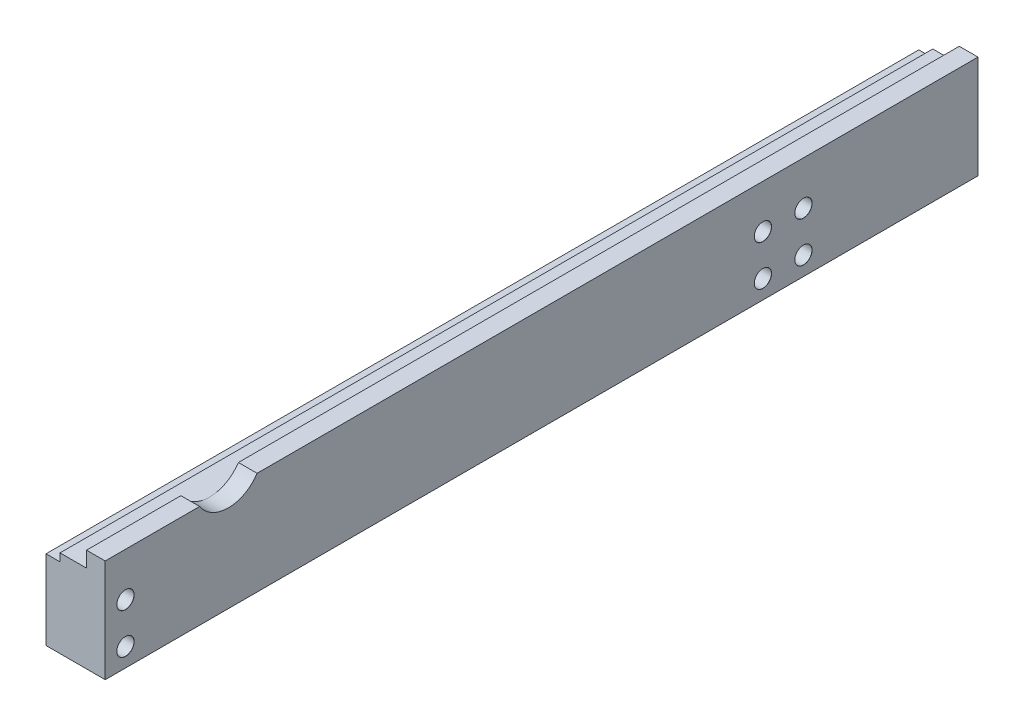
ISO-10303-21;
HEADER;
FILE_DESCRIPTION(('STEP AP214'),'2;1');
FILE_NAME('part.step','',(''),(''),'','','');
FILE_SCHEMA(('AUTOMOTIVE_DESIGN { 1 0 10303 214 1 1 1 1 }'));
ENDSEC;
DATA;
#1=APPLICATION_CONTEXT('core data for automotive mechanical design processes');
#2=APPLICATION_PROTOCOL_DEFINITION('international standard','automotive_design',2000,#1);
#3=PRODUCT_CONTEXT('',#1,'mechanical');
#4=PRODUCT('Part','Part','',(#3));
#5=PRODUCT_RELATED_PRODUCT_CATEGORY('part','',(#4));
#6=PRODUCT_DEFINITION_FORMATION('','',#4);
#7=PRODUCT_DEFINITION_CONTEXT('part definition',#1,'design');
#8=PRODUCT_DEFINITION('design','',#6,#7);
#9=PRODUCT_DEFINITION_SHAPE('','',#8);
#10=(LENGTH_UNIT() NAMED_UNIT(*) SI_UNIT(.MILLI.,.METRE.));
#11=(NAMED_UNIT(*) PLANE_ANGLE_UNIT() SI_UNIT($,.RADIAN.));
#12=(NAMED_UNIT(*) SI_UNIT($,.STERADIAN.) SOLID_ANGLE_UNIT());
#13=UNCERTAINTY_MEASURE_WITH_UNIT(LENGTH_MEASURE(1.E-05),#10,'distance_accuracy_value','');
#14=(GEOMETRIC_REPRESENTATION_CONTEXT(3) GLOBAL_UNCERTAINTY_ASSIGNED_CONTEXT((#13)) GLOBAL_UNIT_ASSIGNED_CONTEXT((#10,
#11,#12)) REPRESENTATION_CONTEXT('',''));
#15=CARTESIAN_POINT('',(0.,0.,0.));
#16=DIRECTION('',(0.,0.,1.));
#17=DIRECTION('',(1.,0.,0.));
#18=AXIS2_PLACEMENT_3D('',#15,#16,#17);
#19=CARTESIAN_POINT('',(-159.,251.054588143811,280.));
#20=DIRECTION('',(0.,-1.,0.));
#21=DIRECTION('',(0.,0.,-1.));
#22=AXIS2_PLACEMENT_3D('',#19,#20,#21);
#23=PLANE('',#22);
#24=DIRECTION('',(0.,0.,-1.));
#25=VECTOR('',#24,1.);
#26=CARTESIAN_POINT('',(-165.,251.054588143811,280.));
#27=LINE('',#26,#25);
#28=CARTESIAN_POINT('',(-165.,251.054588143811,231.280455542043));
#29=VERTEX_POINT('',#28);
#30=CARTESIAN_POINT('',(-165.,251.054588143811,0.));
#31=VERTEX_POINT('',#30);
#32=EDGE_CURVE('E161',#29,#31,#27,.T.);
#33=ORIENTED_EDGE('',*,*,#32,.F.);
#34=DIRECTION('',(1.,0.,0.));
#35=VECTOR('',#34,1.);
#36=CARTESIAN_POINT('',(-178.,251.054588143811,231.280455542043));
#37=LINE('',#36,#35);
#38=CARTESIAN_POINT('',(-159.,251.054588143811,231.280455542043));
#39=VERTEX_POINT('',#38);
#40=EDGE_CURVE('E31',#29,#39,#37,.T.);
#41=ORIENTED_EDGE('',*,*,#40,.T.);
#42=DIRECTION('',(0.,0.,-1.));
#43=VECTOR('',#42,1.);
#44=CARTESIAN_POINT('',(-159.,251.054588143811,280.));
#45=LINE('',#44,#43);
#46=CARTESIAN_POINT('',(-159.,251.054588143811,0.));
#47=VERTEX_POINT('',#46);
#48=EDGE_CURVE('E24',#39,#47,#45,.T.);
#49=ORIENTED_EDGE('',*,*,#48,.T.);
#50=DIRECTION('',(-1.,0.,0.));
#51=VECTOR('',#50,1.);
#52=CARTESIAN_POINT('',(-159.,251.054588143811,0.));
#53=LINE('',#52,#51);
#54=EDGE_CURVE('E145',#47,#31,#53,.T.);
#55=ORIENTED_EDGE('',*,*,#54,.T.);
#56=EDGE_LOOP('',(#33,#41,#49,#55));
#57=FACE_BOUND('',#56,.T.);
#58=ADVANCED_FACE('F16',(#57),#23,.F.);
#59=CARTESIAN_POINT('',(-165.,251.054588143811,280.));
#60=DIRECTION('',(1.,0.,0.));
#61=DIRECTION('',(0.,0.,-1.));
#62=AXIS2_PLACEMENT_3D('',#59,#60,#61);
#63=PLANE('',#62);
#64=CARTESIAN_POINT('',(-165.,251.054588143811,280.));
#65=VERTEX_POINT('',#64);
#66=CARTESIAN_POINT('',(-165.,251.054588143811,249.719544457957));
#67=VERTEX_POINT('',#66);
#68=EDGE_CURVE('E117',#65,#67,#27,.T.);
#69=ORIENTED_EDGE('',*,*,#68,.T.);
#70=CARTESIAN_POINT('',(-165.,257.05458814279,240.5));
#71=DIRECTION('',(1.,0.,0.));
#72=DIRECTION('',(0.,0.,-1.));
#73=AXIS2_PLACEMENT_3D('',#70,#71,#72);
#74=CIRCLE('',#73,11.);
#75=CARTESIAN_POINT('',(-165.,246.0545881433,240.5));
#76=VERTEX_POINT('',#75);
#77=EDGE_CURVE('E100',#67,#76,#74,.T.);
#78=ORIENTED_EDGE('',*,*,#77,.T.);
#79=DIRECTION('',(0.,0.,-1.));
#80=VECTOR('',#79,1.);
#81=CARTESIAN_POINT('',(-165.,246.05458814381,280.));
#82=LINE('',#81,#80);
#83=CARTESIAN_POINT('',(-165.,246.05458814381,280.));
#84=VERTEX_POINT('',#83);
#85=EDGE_CURVE('E146',#84,#76,#82,.T.);
#86=ORIENTED_EDGE('',*,*,#85,.F.);
#87=DIRECTION('',(0.,-1.,0.));
#88=VECTOR('',#87,1.);
#89=CARTESIAN_POINT('',(-165.,251.054588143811,280.));
#90=LINE('',#89,#88);
#91=EDGE_CURVE('E121',#65,#84,#90,.T.);
#92=ORIENTED_EDGE('',*,*,#91,.F.);
#93=EDGE_LOOP('',(#69,#78,#86,#92));
#94=FACE_BOUND('',#93,.T.);
#95=ADVANCED_FACE('F392',(#94),#63,.F.);
#96=CARTESIAN_POINT('',(-159.,218.05458814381,280.));
#97=DIRECTION('',(-1.,0.,0.));
#98=DIRECTION('',(0.,0.,1.));
#99=AXIS2_PLACEMENT_3D('',#96,#97,#98);
#100=PLANE('',#99);
#101=CARTESIAN_POINT('',(-159.,224.05458814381,56.));
#102=DIRECTION('',(-1.,0.,0.));
#103=DIRECTION('',(0.,0.,1.));
#104=AXIS2_PLACEMENT_3D('',#101,#102,#103);
#105=CIRCLE('',#104,2.775);
#106=CARTESIAN_POINT('',(-159.,224.05458814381,58.775));
#107=VERTEX_POINT('',#106);
#108=EDGE_CURVE('E318',#107,#107,#105,.T.);
#109=ORIENTED_EDGE('',*,*,#108,.T.);
#110=EDGE_LOOP('',(#109));
#111=FACE_BOUND('',#110,.T.);
#112=CARTESIAN_POINT('',(-159.,237.05458814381,56.));
#113=DIRECTION('',(-1.,0.,0.));
#114=DIRECTION('',(0.,0.,1.));
#115=AXIS2_PLACEMENT_3D('',#112,#113,#114);
#116=CIRCLE('',#115,2.775);
#117=CARTESIAN_POINT('',(-159.,237.05458814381,58.775));
#118=VERTEX_POINT('',#117);
#119=EDGE_CURVE('E297',#118,#118,#116,.T.);
#120=ORIENTED_EDGE('',*,*,#119,.T.);
#121=EDGE_LOOP('',(#120));
#122=FACE_BOUND('',#121,.T.);
#123=CARTESIAN_POINT('',(-159.,237.05458814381,69.));
#124=DIRECTION('',(-1.,0.,0.));
#125=DIRECTION('',(0.,0.,1.));
#126=AXIS2_PLACEMENT_3D('',#123,#124,#125);
#127=CIRCLE('',#126,2.775);
#128=CARTESIAN_POINT('',(-159.,237.05458814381,71.775));
#129=VERTEX_POINT('',#128);
#130=EDGE_CURVE('E276',#129,#129,#127,.T.);
#131=ORIENTED_EDGE('',*,*,#130,.T.);
#132=EDGE_LOOP('',(#131));
#133=FACE_BOUND('',#132,.T.);
#134=CARTESIAN_POINT('',(-159.,224.05458814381,69.));
#135=DIRECTION('',(-1.,0.,0.));
#136=DIRECTION('',(0.,0.,1.));
#137=AXIS2_PLACEMENT_3D('',#134,#135,#136);
#138=CIRCLE('',#137,2.775);
#139=CARTESIAN_POINT('',(-159.,224.05458814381,71.775));
#140=VERTEX_POINT('',#139);
#141=EDGE_CURVE('E255',#140,#140,#138,.T.);
#142=ORIENTED_EDGE('',*,*,#141,.T.);
#143=EDGE_LOOP('',(#142));
#144=FACE_BOUND('',#143,.T.);
#145=CARTESIAN_POINT('',(-159.,237.05458814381,273.5));
#146=DIRECTION('',(-1.,0.,0.));
#147=DIRECTION('',(0.,0.,1.));
#148=AXIS2_PLACEMENT_3D('',#145,#146,#147);
#149=CIRCLE('',#148,2.775);
#150=CARTESIAN_POINT('',(-159.,237.05458814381,276.275));
#151=VERTEX_POINT('',#150);
#152=EDGE_CURVE('E234',#151,#151,#149,.T.);
#153=ORIENTED_EDGE('',*,*,#152,.T.);
#154=EDGE_LOOP('',(#153));
#155=FACE_BOUND('',#154,.T.);
#156=CARTESIAN_POINT('',(-159.,224.05458814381,273.5));
#157=DIRECTION('',(-1.,0.,0.));
#158=DIRECTION('',(0.,0.,1.));
#159=AXIS2_PLACEMENT_3D('',#156,#157,#158);
#160=CIRCLE('',#159,2.775);
#161=CARTESIAN_POINT('',(-159.,224.05458814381,276.275));
#162=VERTEX_POINT('',#161);
#163=EDGE_CURVE('E213',#162,#162,#160,.T.);
#164=ORIENTED_EDGE('',*,*,#163,.T.);
#165=EDGE_LOOP('',(#164));
#166=FACE_BOUND('',#165,.T.);
#167=ORIENTED_EDGE('',*,*,#48,.F.);
#168=CARTESIAN_POINT('',(-159.,257.05458814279,240.5));
#169=DIRECTION('',(1.,0.,0.));
#170=DIRECTION('',(0.,0.,-1.));
#171=AXIS2_PLACEMENT_3D('',#168,#169,#170);
#172=CIRCLE('',#171,11.);
#173=CARTESIAN_POINT('',(-159.,251.054588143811,249.719544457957));
#174=VERTEX_POINT('',#173);
#175=EDGE_CURVE('E98',#174,#39,#172,.T.);
#176=ORIENTED_EDGE('',*,*,#175,.F.);
#177=CARTESIAN_POINT('',(-159.,251.054588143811,280.));
#178=VERTEX_POINT('',#177);
#179=EDGE_CURVE('E11',#178,#174,#45,.T.);
#180=ORIENTED_EDGE('',*,*,#179,.F.);
#181=DIRECTION('',(0.,1.,0.));
#182=VECTOR('',#181,1.);
#183=CARTESIAN_POINT('',(-159.,218.05458814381,280.));
#184=LINE('',#183,#182);
#185=CARTESIAN_POINT('',(-159.,218.05458814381,280.));
#186=VERTEX_POINT('',#185);
#187=EDGE_CURVE('E122',#186,#178,#184,.T.);
#188=ORIENTED_EDGE('',*,*,#187,.F.);
#189=DIRECTION('',(0.,0.,-1.));
#190=VECTOR('',#189,1.);
#191=CARTESIAN_POINT('',(-159.,218.05458814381,280.));
#192=LINE('',#191,#190);
#193=CARTESIAN_POINT('',(-159.,218.05458814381,0.));
#194=VERTEX_POINT('',#193);
#195=EDGE_CURVE('E142',#186,#194,#192,.T.);
#196=ORIENTED_EDGE('',*,*,#195,.T.);
#197=DIRECTION('',(0.,1.,0.));
#198=VECTOR('',#197,1.);
#199=CARTESIAN_POINT('',(-159.,218.05458814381,0.));
#200=LINE('',#199,#198);
#201=EDGE_CURVE('E143',#194,#47,#200,.T.);
#202=ORIENTED_EDGE('',*,*,#201,.T.);
#203=EDGE_LOOP('',(#167,#176,#180,#188,#196,#202));
#204=FACE_BOUND('',#203,.T.);
#205=ADVANCED_FACE('F18',(#111,#122,#133,#144,#155,#166,#204),#100,.F.);
#206=ORIENTED_EDGE('',*,*,#179,.T.);
#207=DIRECTION('',(1.,0.,0.));
#208=VECTOR('',#207,1.);
#209=CARTESIAN_POINT('',(-178.,251.054588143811,249.719544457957));
#210=LINE('',#209,#208);
#211=EDGE_CURVE('E95',#174,#67,#210,.F.);
#212=ORIENTED_EDGE('',*,*,#211,.T.);
#213=ORIENTED_EDGE('',*,*,#68,.F.);
#214=DIRECTION('',(-1.,0.,0.));
#215=VECTOR('',#214,1.);
#216=CARTESIAN_POINT('',(-159.,251.054588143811,280.));
#217=LINE('',#216,#215);
#218=EDGE_CURVE('E115',#178,#65,#217,.T.);
#219=ORIENTED_EDGE('',*,*,#218,.F.);
#220=EDGE_LOOP('',(#206,#212,#213,#219));
#221=FACE_BOUND('',#220,.T.);
#222=ADVANCED_FACE('F114',(#221),#23,.F.);
#223=CARTESIAN_POINT('',(-165.,246.05458814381,0.));
#224=VERTEX_POINT('',#223);
#225=EDGE_CURVE('E188',#76,#224,#82,.T.);
#226=ORIENTED_EDGE('',*,*,#225,.F.);
#227=EDGE_CURVE('E111',#76,#29,#74,.T.);
#228=ORIENTED_EDGE('',*,*,#227,.T.);
#229=ORIENTED_EDGE('',*,*,#32,.T.);
#230=DIRECTION('',(0.,-1.,0.));
#231=VECTOR('',#230,1.);
#232=CARTESIAN_POINT('',(-165.,251.054588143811,0.));
#233=LINE('',#232,#231);
#234=EDGE_CURVE('E149',#31,#224,#233,.T.);
#235=ORIENTED_EDGE('',*,*,#234,.T.);
#236=EDGE_LOOP('',(#226,#228,#229,#235));
#237=FACE_BOUND('',#236,.T.);
#238=ADVANCED_FACE('F166',(#237),#63,.F.);
#239=CARTESIAN_POINT('',(-178.,243.55458814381,280.));
#240=DIRECTION('',(0.,-1.,0.));
#241=DIRECTION('',(0.,0.,-1.));
#242=AXIS2_PLACEMENT_3D('',#239,#240,#241);
#243=PLANE('',#242);
#244=DIRECTION('',(-1.,0.,0.));
#245=VECTOR('',#244,1.);
#246=CARTESIAN_POINT('',(-178.,243.55458814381,280.));
#247=LINE('',#246,#245);
#248=CARTESIAN_POINT('',(-173.5,243.55458814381,280.));
#249=VERTEX_POINT('',#248);
#250=CARTESIAN_POINT('',(-178.,243.55458814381,280.));
#251=VERTEX_POINT('',#250);
#252=EDGE_CURVE('E39',#249,#251,#247,.T.);
#253=ORIENTED_EDGE('',*,*,#252,.F.);
#254=DIRECTION('',(0.,0.,-1.));
#255=VECTOR('',#254,1.);
#256=CARTESIAN_POINT('',(-173.5,243.55458814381,280.));
#257=LINE('',#256,#255);
#258=CARTESIAN_POINT('',(-173.5,243.55458814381,0.));
#259=VERTEX_POINT('',#258);
#260=EDGE_CURVE('E134',#249,#259,#257,.T.);
#261=ORIENTED_EDGE('',*,*,#260,.T.);
#262=DIRECTION('',(-1.,0.,0.));
#263=VECTOR('',#262,1.);
#264=CARTESIAN_POINT('',(-178.,243.55458814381,0.));
#265=LINE('',#264,#263);
#266=CARTESIAN_POINT('',(-178.,243.55458814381,0.));
#267=VERTEX_POINT('',#266);
#268=EDGE_CURVE('E152',#259,#267,#265,.T.);
#269=ORIENTED_EDGE('',*,*,#268,.T.);
#270=DIRECTION('',(0.,0.,-1.));
#271=VECTOR('',#270,1.);
#272=CARTESIAN_POINT('',(-178.,243.55458814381,280.));
#273=LINE('',#272,#271);
#274=EDGE_CURVE('E159',#251,#267,#273,.T.);
#275=ORIENTED_EDGE('',*,*,#274,.F.);
#276=EDGE_LOOP('',(#253,#261,#269,#275));
#277=FACE_BOUND('',#276,.T.);
#278=ADVANCED_FACE('F365',(#277),#243,.F.);
#279=CARTESIAN_POINT('',(-178.,218.05458814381,280.));
#280=DIRECTION('',(1.,0.,0.));
#281=DIRECTION('',(0.,0.,-1.));
#282=AXIS2_PLACEMENT_3D('',#279,#280,#281);
#283=PLANE('',#282);
#284=CARTESIAN_POINT('',(-178.,224.05458814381,56.));
#285=DIRECTION('',(-1.,0.,0.));
#286=DIRECTION('',(0.,0.,1.));
#287=AXIS2_PLACEMENT_3D('',#284,#285,#286);
#288=CIRCLE('',#287,5.025);
#289=CARTESIAN_POINT('',(-178.,224.05458814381,61.025));
#290=VERTEX_POINT('',#289);
#291=EDGE_CURVE('E315',#290,#290,#288,.T.);
#292=ORIENTED_EDGE('',*,*,#291,.F.);
#293=EDGE_LOOP('',(#292));
#294=FACE_BOUND('',#293,.T.);
#295=CARTESIAN_POINT('',(-178.,237.05458814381,56.));
#296=DIRECTION('',(-1.,0.,0.));
#297=DIRECTION('',(0.,0.,1.));
#298=AXIS2_PLACEMENT_3D('',#295,#296,#297);
#299=CIRCLE('',#298,5.025);
#300=CARTESIAN_POINT('',(-178.,237.05458814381,61.025));
#301=VERTEX_POINT('',#300);
#302=EDGE_CURVE('E294',#301,#301,#299,.T.);
#303=ORIENTED_EDGE('',*,*,#302,.F.);
#304=EDGE_LOOP('',(#303));
#305=FACE_BOUND('',#304,.T.);
#306=CARTESIAN_POINT('',(-178.,237.05458814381,69.));
#307=DIRECTION('',(-1.,0.,0.));
#308=DIRECTION('',(0.,0.,1.));
#309=AXIS2_PLACEMENT_3D('',#306,#307,#308);
#310=CIRCLE('',#309,5.025);
#311=CARTESIAN_POINT('',(-178.,237.05458814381,74.025));
#312=VERTEX_POINT('',#311);
#313=EDGE_CURVE('E273',#312,#312,#310,.T.);
#314=ORIENTED_EDGE('',*,*,#313,.F.);
#315=EDGE_LOOP('',(#314));
#316=FACE_BOUND('',#315,.T.);
#317=CARTESIAN_POINT('',(-178.,224.05458814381,69.));
#318=DIRECTION('',(-1.,0.,0.));
#319=DIRECTION('',(0.,0.,1.));
#320=AXIS2_PLACEMENT_3D('',#317,#318,#319);
#321=CIRCLE('',#320,5.025);
#322=CARTESIAN_POINT('',(-178.,224.05458814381,74.025));
#323=VERTEX_POINT('',#322);
#324=EDGE_CURVE('E252',#323,#323,#321,.T.);
#325=ORIENTED_EDGE('',*,*,#324,.F.);
#326=EDGE_LOOP('',(#325));
#327=FACE_BOUND('',#326,.T.);
#328=CARTESIAN_POINT('',(-178.,237.05458814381,273.5));
#329=DIRECTION('',(-1.,0.,0.));
#330=DIRECTION('',(0.,0.,1.));
#331=AXIS2_PLACEMENT_3D('',#328,#329,#330);
#332=CIRCLE('',#331,5.025);
#333=CARTESIAN_POINT('',(-178.,237.05458814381,278.525));
#334=VERTEX_POINT('',#333);
#335=EDGE_CURVE('E231',#334,#334,#332,.T.);
#336=ORIENTED_EDGE('',*,*,#335,.F.);
#337=EDGE_LOOP('',(#336));
#338=FACE_BOUND('',#337,.T.);
#339=CARTESIAN_POINT('',(-178.,224.05458814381,273.5));
#340=DIRECTION('',(-1.,0.,0.));
#341=DIRECTION('',(0.,0.,1.));
#342=AXIS2_PLACEMENT_3D('',#339,#340,#341);
#343=CIRCLE('',#342,5.025);
#344=CARTESIAN_POINT('',(-178.,224.05458814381,278.525));
#345=VERTEX_POINT('',#344);
#346=EDGE_CURVE('E210',#345,#345,#343,.T.);
#347=ORIENTED_EDGE('',*,*,#346,.F.);
#348=EDGE_LOOP('',(#347));
#349=FACE_BOUND('',#348,.T.);
#350=DIRECTION('',(0.,-1.,0.));
#351=VECTOR('',#350,1.);
#352=CARTESIAN_POINT('',(-178.,218.05458814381,0.));
#353=LINE('',#352,#351);
#354=CARTESIAN_POINT('',(-178.,218.05458814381,0.));
#355=VERTEX_POINT('',#354);
#356=EDGE_CURVE('E131',#267,#355,#353,.T.);
#357=ORIENTED_EDGE('',*,*,#356,.T.);
#358=DIRECTION('',(0.,0.,-1.));
#359=VECTOR('',#358,1.);
#360=CARTESIAN_POINT('',(-178.,218.05458814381,280.));
#361=LINE('',#360,#359);
#362=CARTESIAN_POINT('',(-178.,218.05458814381,280.));
#363=VERTEX_POINT('',#362);
#364=EDGE_CURVE('E156',#363,#355,#361,.T.);
#365=ORIENTED_EDGE('',*,*,#364,.F.);
#366=DIRECTION('',(0.,-1.,0.));
#367=VECTOR('',#366,1.);
#368=CARTESIAN_POINT('',(-178.,218.05458814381,280.));
#369=LINE('',#368,#367);
#370=EDGE_CURVE('E139',#251,#363,#369,.T.);
#371=ORIENTED_EDGE('',*,*,#370,.F.);
#372=ORIENTED_EDGE('',*,*,#274,.T.);
#373=EDGE_LOOP('',(#357,#365,#371,#372));
#374=FACE_BOUND('',#373,.T.);
#375=ADVANCED_FACE('F361',(#294,#305,#316,#327,#338,#349,#374),#283,.F.);
#376=CARTESIAN_POINT('',(-159.,218.05458814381,280.));
#377=DIRECTION('',(0.,1.,0.));
#378=DIRECTION('',(0.,0.,1.));
#379=AXIS2_PLACEMENT_3D('',#376,#377,#378);
#380=PLANE('',#379);
#381=DIRECTION('',(1.,0.,0.));
#382=VECTOR('',#381,1.);
#383=CARTESIAN_POINT('',(-159.,218.05458814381,0.));
#384=LINE('',#383,#382);
#385=EDGE_CURVE('E129',#355,#194,#384,.T.);
#386=ORIENTED_EDGE('',*,*,#385,.T.);
#387=ORIENTED_EDGE('',*,*,#195,.F.);
#388=DIRECTION('',(1.,0.,0.));
#389=VECTOR('',#388,1.);
#390=CARTESIAN_POINT('',(-159.,218.05458814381,280.));
#391=LINE('',#390,#389);
#392=EDGE_CURVE('E126',#363,#186,#391,.T.);
#393=ORIENTED_EDGE('',*,*,#392,.F.);
#394=ORIENTED_EDGE('',*,*,#364,.T.);
#395=EDGE_LOOP('',(#386,#387,#393,#394));
#396=FACE_BOUND('',#395,.T.);
#397=ADVANCED_FACE('F364',(#396),#380,.F.);
#398=CARTESIAN_POINT('',(0.,0.,280.));
#399=DIRECTION('',(0.,0.,1.));
#400=DIRECTION('',(1.,0.,0.));
#401=AXIS2_PLACEMENT_3D('',#398,#399,#400);
#402=PLANE('',#401);
#403=ORIENTED_EDGE('',*,*,#187,.T.);
#404=ORIENTED_EDGE('',*,*,#218,.T.);
#405=ORIENTED_EDGE('',*,*,#91,.T.);
#406=DIRECTION('',(1.,0.,0.));
#407=VECTOR('',#406,1.);
#408=CARTESIAN_POINT('',(-165.,246.05458814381,280.));
#409=LINE('',#408,#407);
#410=CARTESIAN_POINT('',(-173.5,246.05458814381,280.));
#411=VERTEX_POINT('',#410);
#412=EDGE_CURVE('E182',#411,#84,#409,.T.);
#413=ORIENTED_EDGE('',*,*,#412,.F.);
#414=DIRECTION('',(0.,1.,0.));
#415=VECTOR('',#414,1.);
#416=CARTESIAN_POINT('',(-173.5,243.55458814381,280.));
#417=LINE('',#416,#415);
#418=EDGE_CURVE('E179',#249,#411,#417,.T.);
#419=ORIENTED_EDGE('',*,*,#418,.F.);
#420=ORIENTED_EDGE('',*,*,#252,.T.);
#421=ORIENTED_EDGE('',*,*,#370,.T.);
#422=ORIENTED_EDGE('',*,*,#392,.T.);
#423=EDGE_LOOP('',(#403,#404,#405,#413,#419,#420,#421,#422));
#424=FACE_BOUND('',#423,.T.);
#425=ADVANCED_FACE('F124',(#424),#402,.T.);
#426=CARTESIAN_POINT('',(0.,0.,0.));
#427=DIRECTION('',(0.,0.,1.));
#428=DIRECTION('',(1.,0.,0.));
#429=AXIS2_PLACEMENT_3D('',#426,#427,#428);
#430=PLANE('',#429);
#431=ORIENTED_EDGE('',*,*,#201,.F.);
#432=ORIENTED_EDGE('',*,*,#385,.F.);
#433=ORIENTED_EDGE('',*,*,#356,.F.);
#434=ORIENTED_EDGE('',*,*,#268,.F.);
#435=DIRECTION('',(0.,1.,0.));
#436=VECTOR('',#435,1.);
#437=CARTESIAN_POINT('',(-173.5,243.55458814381,0.));
#438=LINE('',#437,#436);
#439=CARTESIAN_POINT('',(-173.5,246.05458814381,0.));
#440=VERTEX_POINT('',#439);
#441=EDGE_CURVE('E104',#259,#440,#438,.T.);
#442=ORIENTED_EDGE('',*,*,#441,.T.);
#443=DIRECTION('',(1.,0.,0.));
#444=VECTOR('',#443,1.);
#445=CARTESIAN_POINT('',(-165.,246.05458814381,0.));
#446=LINE('',#445,#444);
#447=EDGE_CURVE('E176',#440,#224,#446,.T.);
#448=ORIENTED_EDGE('',*,*,#447,.T.);
#449=ORIENTED_EDGE('',*,*,#234,.F.);
#450=ORIENTED_EDGE('',*,*,#54,.F.);
#451=EDGE_LOOP('',(#431,#432,#433,#434,#442,#448,#449,#450));
#452=FACE_BOUND('',#451,.T.);
#453=ADVANCED_FACE('F173',(#452),#430,.F.);
#454=CARTESIAN_POINT('',(-165.,246.05458814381,280.));
#455=DIRECTION('',(0.,1.,0.));
#456=DIRECTION('',(0.,0.,1.));
#457=AXIS2_PLACEMENT_3D('',#454,#455,#456);
#458=PLANE('',#457);
#459=ORIENTED_EDGE('',*,*,#85,.T.);
#460=ORIENTED_EDGE('',*,*,#225,.T.);
#461=ORIENTED_EDGE('',*,*,#447,.F.);
#462=DIRECTION('',(0.,0.,-1.));
#463=VECTOR('',#462,1.);
#464=CARTESIAN_POINT('',(-173.5,246.05458814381,280.));
#465=LINE('',#464,#463);
#466=EDGE_CURVE('E189',#411,#440,#465,.T.);
#467=ORIENTED_EDGE('',*,*,#466,.F.);
#468=ORIENTED_EDGE('',*,*,#412,.T.);
#469=EDGE_LOOP('',(#459,#460,#461,#467,#468));
#470=FACE_BOUND('',#469,.T.);
#471=ADVANCED_FACE('F779',(#470),#458,.T.);
#472=CARTESIAN_POINT('',(-173.5,243.55458814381,280.));
#473=DIRECTION('',(-1.,0.,0.));
#474=DIRECTION('',(0.,0.,1.));
#475=AXIS2_PLACEMENT_3D('',#472,#473,#474);
#476=PLANE('',#475);
#477=ORIENTED_EDGE('',*,*,#441,.F.);
#478=ORIENTED_EDGE('',*,*,#260,.F.);
#479=ORIENTED_EDGE('',*,*,#418,.T.);
#480=ORIENTED_EDGE('',*,*,#466,.T.);
#481=EDGE_LOOP('',(#477,#478,#479,#480));
#482=FACE_BOUND('',#481,.T.);
#483=ADVANCED_FACE('F770',(#482),#476,.T.);
#484=CARTESIAN_POINT('',(-178.,257.05458814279,240.5));
#485=DIRECTION('',(1.,0.,0.));
#486=DIRECTION('',(0.,0.,-1.));
#487=AXIS2_PLACEMENT_3D('',#484,#485,#486);
#488=CYLINDRICAL_SURFACE('',#487,11.);
#489=ORIENTED_EDGE('',*,*,#175,.T.);
#490=ORIENTED_EDGE('',*,*,#40,.F.);
#491=ORIENTED_EDGE('',*,*,#227,.F.);
#492=ORIENTED_EDGE('',*,*,#77,.F.);
#493=ORIENTED_EDGE('',*,*,#211,.F.);
#494=EDGE_LOOP('',(#489,#490,#491,#492,#493));
#495=FACE_BOUND('',#494,.T.);
#496=ADVANCED_FACE('F97',(#495),#488,.F.);
#497=CARTESIAN_POINT('',(-159.025,224.05458814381,273.5));
#498=DIRECTION('',(1.,0.,0.));
#499=DIRECTION('',(0.,0.,-1.));
#500=AXIS2_PLACEMENT_3D('',#497,#498,#499);
#501=CONICAL_SURFACE('',#500,2.75,0.785398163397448);
#502=ORIENTED_EDGE('',*,*,#163,.F.);
#503=EDGE_LOOP('',(#502));
#504=FACE_BOUND('',#503,.T.);
#505=CARTESIAN_POINT('',(-159.025,224.05458814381,273.5));
#506=DIRECTION('',(-1.,0.,0.));
#507=DIRECTION('',(0.,0.,1.));
#508=AXIS2_PLACEMENT_3D('',#505,#506,#507);
#509=CIRCLE('',#508,2.75);
#510=CARTESIAN_POINT('',(-159.025,224.05458814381,276.25));
#511=VERTEX_POINT('',#510);
#512=EDGE_CURVE('E112',#511,#511,#509,.T.);
#513=ORIENTED_EDGE('',*,*,#512,.T.);
#514=EDGE_LOOP('',(#513));
#515=FACE_BOUND('',#514,.T.);
#516=ADVANCED_FACE('F751',(#504,#515),#501,.F.);
#517=CARTESIAN_POINT('',(-178.,224.05458814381,273.5));
#518=DIRECTION('',(-1.,0.,0.));
#519=DIRECTION('',(0.,0.,1.));
#520=AXIS2_PLACEMENT_3D('',#517,#518,#519);
#521=CYLINDRICAL_SURFACE('',#520,2.75);
#522=ORIENTED_EDGE('',*,*,#512,.F.);
#523=EDGE_LOOP('',(#522));
#524=FACE_BOUND('',#523,.T.);
#525=CARTESIAN_POINT('',(-172.275,224.05458814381,273.5));
#526=DIRECTION('',(-1.,0.,0.));
#527=DIRECTION('',(0.,0.,1.));
#528=AXIS2_PLACEMENT_3D('',#525,#526,#527);
#529=CIRCLE('',#528,2.75);
#530=CARTESIAN_POINT('',(-172.275,224.05458814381,276.25));
#531=VERTEX_POINT('',#530);
#532=EDGE_CURVE('E198',#531,#531,#529,.T.);
#533=ORIENTED_EDGE('',*,*,#532,.T.);
#534=EDGE_LOOP('',(#533));
#535=FACE_BOUND('',#534,.T.);
#536=ADVANCED_FACE('F741',(#524,#535),#521,.F.);
#537=CARTESIAN_POINT('',(-172.3,224.05458814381,273.5));
#538=DIRECTION('',(-1.,0.,0.));
#539=DIRECTION('',(0.,0.,1.));
#540=AXIS2_PLACEMENT_3D('',#537,#538,#539);
#541=CONICAL_SURFACE('',#540,2.775,0.785398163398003);
#542=ORIENTED_EDGE('',*,*,#532,.F.);
#543=EDGE_LOOP('',(#542));
#544=FACE_BOUND('',#543,.T.);
#545=CARTESIAN_POINT('',(-172.3,224.05458814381,273.5));
#546=DIRECTION('',(-1.,0.,0.));
#547=DIRECTION('',(0.,0.,1.));
#548=AXIS2_PLACEMENT_3D('',#545,#546,#547);
#549=CIRCLE('',#548,2.775);
#550=CARTESIAN_POINT('',(-172.3,224.05458814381,276.275));
#551=VERTEX_POINT('',#550);
#552=EDGE_CURVE('E201',#551,#551,#549,.T.);
#553=ORIENTED_EDGE('',*,*,#552,.T.);
#554=EDGE_LOOP('',(#553));
#555=FACE_BOUND('',#554,.T.);
#556=ADVANCED_FACE('F731',(#544,#555),#541,.F.);
#557=CARTESIAN_POINT('',(-172.3,226.82958814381,273.5));
#558=DIRECTION('',(1.,0.,0.));
#559=DIRECTION('',(0.,0.,-1.));
#560=AXIS2_PLACEMENT_3D('',#557,#558,#559);
#561=PLANE('',#560);
#562=ORIENTED_EDGE('',*,*,#552,.F.);
#563=EDGE_LOOP('',(#562));
#564=FACE_BOUND('',#563,.T.);
#565=CARTESIAN_POINT('',(-172.3,224.05458814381,273.5));
#566=DIRECTION('',(-1.,0.,0.));
#567=DIRECTION('',(0.,0.,1.));
#568=AXIS2_PLACEMENT_3D('',#565,#566,#567);
#569=CIRCLE('',#568,5.);
#570=CARTESIAN_POINT('',(-172.3,224.05458814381,278.5));
#571=VERTEX_POINT('',#570);
#572=EDGE_CURVE('E204',#571,#571,#569,.T.);
#573=ORIENTED_EDGE('',*,*,#572,.T.);
#574=EDGE_LOOP('',(#573));
#575=FACE_BOUND('',#574,.T.);
#576=ADVANCED_FACE('F721',(#564,#575),#561,.F.);
#577=CARTESIAN_POINT('',(-178.,224.05458814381,273.5));
#578=DIRECTION('',(-1.,0.,0.));
#579=DIRECTION('',(0.,0.,1.));
#580=AXIS2_PLACEMENT_3D('',#577,#578,#579);
#581=CYLINDRICAL_SURFACE('',#580,5.);
#582=ORIENTED_EDGE('',*,*,#572,.F.);
#583=EDGE_LOOP('',(#582));
#584=FACE_BOUND('',#583,.T.);
#585=CARTESIAN_POINT('',(-177.975,224.05458814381,273.5));
#586=DIRECTION('',(-1.,0.,0.));
#587=DIRECTION('',(0.,0.,1.));
#588=AXIS2_PLACEMENT_3D('',#585,#586,#587);
#589=CIRCLE('',#588,5.);
#590=CARTESIAN_POINT('',(-177.975,224.05458814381,278.5));
#591=VERTEX_POINT('',#590);
#592=EDGE_CURVE('E207',#591,#591,#589,.T.);
#593=ORIENTED_EDGE('',*,*,#592,.T.);
#594=EDGE_LOOP('',(#593));
#595=FACE_BOUND('',#594,.T.);
#596=ADVANCED_FACE('F711',(#584,#595),#581,.F.);
#597=CARTESIAN_POINT('',(-178.,224.05458814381,273.5));
#598=DIRECTION('',(-1.,0.,0.));
#599=DIRECTION('',(0.,0.,1.));
#600=AXIS2_PLACEMENT_3D('',#597,#598,#599);
#601=CONICAL_SURFACE('',#600,5.025,0.785398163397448);
#602=ORIENTED_EDGE('',*,*,#592,.F.);
#603=EDGE_LOOP('',(#602));
#604=FACE_BOUND('',#603,.T.);
#605=ORIENTED_EDGE('',*,*,#346,.T.);
#606=EDGE_LOOP('',(#605));
#607=FACE_BOUND('',#606,.T.);
#608=ADVANCED_FACE('F701',(#604,#607),#601,.F.);
#609=CARTESIAN_POINT('',(-159.025,237.05458814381,273.5));
#610=DIRECTION('',(1.,0.,0.));
#611=DIRECTION('',(0.,0.,-1.));
#612=AXIS2_PLACEMENT_3D('',#609,#610,#611);
#613=CONICAL_SURFACE('',#612,2.75,0.785398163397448);
#614=ORIENTED_EDGE('',*,*,#152,.F.);
#615=EDGE_LOOP('',(#614));
#616=FACE_BOUND('',#615,.T.);
#617=CARTESIAN_POINT('',(-159.025,237.05458814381,273.5));
#618=DIRECTION('',(-1.,0.,0.));
#619=DIRECTION('',(0.,0.,1.));
#620=AXIS2_PLACEMENT_3D('',#617,#618,#619);
#621=CIRCLE('',#620,2.75);
#622=CARTESIAN_POINT('',(-159.025,237.05458814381,276.25));
#623=VERTEX_POINT('',#622);
#624=EDGE_CURVE('E216',#623,#623,#621,.T.);
#625=ORIENTED_EDGE('',*,*,#624,.T.);
#626=EDGE_LOOP('',(#625));
#627=FACE_BOUND('',#626,.T.);
#628=ADVANCED_FACE('F691',(#616,#627),#613,.F.);
#629=CARTESIAN_POINT('',(-178.,237.05458814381,273.5));
#630=DIRECTION('',(-1.,0.,0.));
#631=DIRECTION('',(0.,0.,1.));
#632=AXIS2_PLACEMENT_3D('',#629,#630,#631);
#633=CYLINDRICAL_SURFACE('',#632,2.75);
#634=ORIENTED_EDGE('',*,*,#624,.F.);
#635=EDGE_LOOP('',(#634));
#636=FACE_BOUND('',#635,.T.);
#637=CARTESIAN_POINT('',(-172.275,237.05458814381,273.5));
#638=DIRECTION('',(-1.,0.,0.));
#639=DIRECTION('',(0.,0.,1.));
#640=AXIS2_PLACEMENT_3D('',#637,#638,#639);
#641=CIRCLE('',#640,2.75);
#642=CARTESIAN_POINT('',(-172.275,237.05458814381,276.25));
#643=VERTEX_POINT('',#642);
#644=EDGE_CURVE('E219',#643,#643,#641,.T.);
#645=ORIENTED_EDGE('',*,*,#644,.T.);
#646=EDGE_LOOP('',(#645));
#647=FACE_BOUND('',#646,.T.);
#648=ADVANCED_FACE('F681',(#636,#647),#633,.F.);
#649=CARTESIAN_POINT('',(-172.3,237.05458814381,273.5));
#650=DIRECTION('',(-1.,0.,0.));
#651=DIRECTION('',(0.,0.,1.));
#652=AXIS2_PLACEMENT_3D('',#649,#650,#651);
#653=CONICAL_SURFACE('',#652,2.775,0.785398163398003);
#654=ORIENTED_EDGE('',*,*,#644,.F.);
#655=EDGE_LOOP('',(#654));
#656=FACE_BOUND('',#655,.T.);
#657=CARTESIAN_POINT('',(-172.3,237.05458814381,273.5));
#658=DIRECTION('',(-1.,0.,0.));
#659=DIRECTION('',(0.,0.,1.));
#660=AXIS2_PLACEMENT_3D('',#657,#658,#659);
#661=CIRCLE('',#660,2.775);
#662=CARTESIAN_POINT('',(-172.3,237.05458814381,276.275));
#663=VERTEX_POINT('',#662);
#664=EDGE_CURVE('E222',#663,#663,#661,.T.);
#665=ORIENTED_EDGE('',*,*,#664,.T.);
#666=EDGE_LOOP('',(#665));
#667=FACE_BOUND('',#666,.T.);
#668=ADVANCED_FACE('F671',(#656,#667),#653,.F.);
#669=CARTESIAN_POINT('',(-172.3,239.82958814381,273.5));
#670=DIRECTION('',(1.,0.,0.));
#671=DIRECTION('',(0.,0.,-1.));
#672=AXIS2_PLACEMENT_3D('',#669,#670,#671);
#673=PLANE('',#672);
#674=ORIENTED_EDGE('',*,*,#664,.F.);
#675=EDGE_LOOP('',(#674));
#676=FACE_BOUND('',#675,.T.);
#677=CARTESIAN_POINT('',(-172.3,237.05458814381,273.5));
#678=DIRECTION('',(-1.,0.,0.));
#679=DIRECTION('',(0.,0.,1.));
#680=AXIS2_PLACEMENT_3D('',#677,#678,#679);
#681=CIRCLE('',#680,5.);
#682=CARTESIAN_POINT('',(-172.3,237.05458814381,278.5));
#683=VERTEX_POINT('',#682);
#684=EDGE_CURVE('E225',#683,#683,#681,.T.);
#685=ORIENTED_EDGE('',*,*,#684,.T.);
#686=EDGE_LOOP('',(#685));
#687=FACE_BOUND('',#686,.T.);
#688=ADVANCED_FACE('F661',(#676,#687),#673,.F.);
#689=CARTESIAN_POINT('',(-178.,237.05458814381,273.5));
#690=DIRECTION('',(-1.,0.,0.));
#691=DIRECTION('',(0.,0.,1.));
#692=AXIS2_PLACEMENT_3D('',#689,#690,#691);
#693=CYLINDRICAL_SURFACE('',#692,5.);
#694=ORIENTED_EDGE('',*,*,#684,.F.);
#695=EDGE_LOOP('',(#694));
#696=FACE_BOUND('',#695,.T.);
#697=CARTESIAN_POINT('',(-177.975,237.05458814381,273.5));
#698=DIRECTION('',(-1.,0.,0.));
#699=DIRECTION('',(0.,0.,1.));
#700=AXIS2_PLACEMENT_3D('',#697,#698,#699);
#701=CIRCLE('',#700,5.);
#702=CARTESIAN_POINT('',(-177.975,237.05458814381,278.5));
#703=VERTEX_POINT('',#702);
#704=EDGE_CURVE('E228',#703,#703,#701,.T.);
#705=ORIENTED_EDGE('',*,*,#704,.T.);
#706=EDGE_LOOP('',(#705));
#707=FACE_BOUND('',#706,.T.);
#708=ADVANCED_FACE('F651',(#696,#707),#693,.F.);
#709=CARTESIAN_POINT('',(-178.,237.05458814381,273.5));
#710=DIRECTION('',(-1.,0.,0.));
#711=DIRECTION('',(0.,0.,1.));
#712=AXIS2_PLACEMENT_3D('',#709,#710,#711);
#713=CONICAL_SURFACE('',#712,5.025,0.785398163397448);
#714=ORIENTED_EDGE('',*,*,#704,.F.);
#715=EDGE_LOOP('',(#714));
#716=FACE_BOUND('',#715,.T.);
#717=ORIENTED_EDGE('',*,*,#335,.T.);
#718=EDGE_LOOP('',(#717));
#719=FACE_BOUND('',#718,.T.);
#720=ADVANCED_FACE('F641',(#716,#719),#713,.F.);
#721=CARTESIAN_POINT('',(-159.025,224.05458814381,69.));
#722=DIRECTION('',(1.,0.,0.));
#723=DIRECTION('',(0.,0.,-1.));
#724=AXIS2_PLACEMENT_3D('',#721,#722,#723);
#725=CONICAL_SURFACE('',#724,2.75,0.785398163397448);
#726=ORIENTED_EDGE('',*,*,#141,.F.);
#727=EDGE_LOOP('',(#726));
#728=FACE_BOUND('',#727,.T.);
#729=CARTESIAN_POINT('',(-159.025,224.05458814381,69.));
#730=DIRECTION('',(-1.,0.,0.));
#731=DIRECTION('',(0.,0.,1.));
#732=AXIS2_PLACEMENT_3D('',#729,#730,#731);
#733=CIRCLE('',#732,2.75);
#734=CARTESIAN_POINT('',(-159.025,224.05458814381,71.75));
#735=VERTEX_POINT('',#734);
#736=EDGE_CURVE('E237',#735,#735,#733,.T.);
#737=ORIENTED_EDGE('',*,*,#736,.T.);
#738=EDGE_LOOP('',(#737));
#739=FACE_BOUND('',#738,.T.);
#740=ADVANCED_FACE('F631',(#728,#739),#725,.F.);
#741=CARTESIAN_POINT('',(-178.,224.05458814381,69.));
#742=DIRECTION('',(-1.,0.,0.));
#743=DIRECTION('',(0.,0.,1.));
#744=AXIS2_PLACEMENT_3D('',#741,#742,#743);
#745=CYLINDRICAL_SURFACE('',#744,2.75);
#746=ORIENTED_EDGE('',*,*,#736,.F.);
#747=EDGE_LOOP('',(#746));
#748=FACE_BOUND('',#747,.T.);
#749=CARTESIAN_POINT('',(-172.275,224.05458814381,69.));
#750=DIRECTION('',(-1.,0.,0.));
#751=DIRECTION('',(0.,0.,1.));
#752=AXIS2_PLACEMENT_3D('',#749,#750,#751);
#753=CIRCLE('',#752,2.75);
#754=CARTESIAN_POINT('',(-172.275,224.05458814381,71.75));
#755=VERTEX_POINT('',#754);
#756=EDGE_CURVE('E240',#755,#755,#753,.T.);
#757=ORIENTED_EDGE('',*,*,#756,.T.);
#758=EDGE_LOOP('',(#757));
#759=FACE_BOUND('',#758,.T.);
#760=ADVANCED_FACE('F621',(#748,#759),#745,.F.);
#761=CARTESIAN_POINT('',(-172.3,224.05458814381,69.));
#762=DIRECTION('',(-1.,0.,0.));
#763=DIRECTION('',(0.,0.,1.));
#764=AXIS2_PLACEMENT_3D('',#761,#762,#763);
#765=CONICAL_SURFACE('',#764,2.775,0.785398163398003);
#766=ORIENTED_EDGE('',*,*,#756,.F.);
#767=EDGE_LOOP('',(#766));
#768=FACE_BOUND('',#767,.T.);
#769=CARTESIAN_POINT('',(-172.3,224.05458814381,69.));
#770=DIRECTION('',(-1.,0.,0.));
#771=DIRECTION('',(0.,0.,1.));
#772=AXIS2_PLACEMENT_3D('',#769,#770,#771);
#773=CIRCLE('',#772,2.775);
#774=CARTESIAN_POINT('',(-172.3,224.05458814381,71.775));
#775=VERTEX_POINT('',#774);
#776=EDGE_CURVE('E243',#775,#775,#773,.T.);
#777=ORIENTED_EDGE('',*,*,#776,.T.);
#778=EDGE_LOOP('',(#777));
#779=FACE_BOUND('',#778,.T.);
#780=ADVANCED_FACE('F611',(#768,#779),#765,.F.);
#781=CARTESIAN_POINT('',(-172.3,226.82958814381,69.));
#782=DIRECTION('',(1.,0.,0.));
#783=DIRECTION('',(0.,0.,-1.));
#784=AXIS2_PLACEMENT_3D('',#781,#782,#783);
#785=PLANE('',#784);
#786=ORIENTED_EDGE('',*,*,#776,.F.);
#787=EDGE_LOOP('',(#786));
#788=FACE_BOUND('',#787,.T.);
#789=CARTESIAN_POINT('',(-172.3,224.05458814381,69.));
#790=DIRECTION('',(-1.,0.,0.));
#791=DIRECTION('',(0.,0.,1.));
#792=AXIS2_PLACEMENT_3D('',#789,#790,#791);
#793=CIRCLE('',#792,5.);
#794=CARTESIAN_POINT('',(-172.3,224.05458814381,74.));
#795=VERTEX_POINT('',#794);
#796=EDGE_CURVE('E246',#795,#795,#793,.T.);
#797=ORIENTED_EDGE('',*,*,#796,.T.);
#798=EDGE_LOOP('',(#797));
#799=FACE_BOUND('',#798,.T.);
#800=ADVANCED_FACE('F601',(#788,#799),#785,.F.);
#801=CARTESIAN_POINT('',(-178.,224.05458814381,69.));
#802=DIRECTION('',(-1.,0.,0.));
#803=DIRECTION('',(0.,0.,1.));
#804=AXIS2_PLACEMENT_3D('',#801,#802,#803);
#805=CYLINDRICAL_SURFACE('',#804,5.);
#806=ORIENTED_EDGE('',*,*,#796,.F.);
#807=EDGE_LOOP('',(#806));
#808=FACE_BOUND('',#807,.T.);
#809=CARTESIAN_POINT('',(-177.975,224.05458814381,69.));
#810=DIRECTION('',(-1.,0.,0.));
#811=DIRECTION('',(0.,0.,1.));
#812=AXIS2_PLACEMENT_3D('',#809,#810,#811);
#813=CIRCLE('',#812,5.);
#814=CARTESIAN_POINT('',(-177.975,224.05458814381,74.));
#815=VERTEX_POINT('',#814);
#816=EDGE_CURVE('E249',#815,#815,#813,.T.);
#817=ORIENTED_EDGE('',*,*,#816,.T.);
#818=EDGE_LOOP('',(#817));
#819=FACE_BOUND('',#818,.T.);
#820=ADVANCED_FACE('F591',(#808,#819),#805,.F.);
#821=CARTESIAN_POINT('',(-178.,224.05458814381,69.));
#822=DIRECTION('',(-1.,0.,0.));
#823=DIRECTION('',(0.,0.,1.));
#824=AXIS2_PLACEMENT_3D('',#821,#822,#823);
#825=CONICAL_SURFACE('',#824,5.025,0.785398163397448);
#826=ORIENTED_EDGE('',*,*,#816,.F.);
#827=EDGE_LOOP('',(#826));
#828=FACE_BOUND('',#827,.T.);
#829=ORIENTED_EDGE('',*,*,#324,.T.);
#830=EDGE_LOOP('',(#829));
#831=FACE_BOUND('',#830,.T.);
#832=ADVANCED_FACE('F581',(#828,#831),#825,.F.);
#833=CARTESIAN_POINT('',(-159.025,237.05458814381,69.));
#834=DIRECTION('',(1.,0.,0.));
#835=DIRECTION('',(0.,0.,-1.));
#836=AXIS2_PLACEMENT_3D('',#833,#834,#835);
#837=CONICAL_SURFACE('',#836,2.75,0.785398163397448);
#838=ORIENTED_EDGE('',*,*,#130,.F.);
#839=EDGE_LOOP('',(#838));
#840=FACE_BOUND('',#839,.T.);
#841=CARTESIAN_POINT('',(-159.025,237.05458814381,69.));
#842=DIRECTION('',(-1.,0.,0.));
#843=DIRECTION('',(0.,0.,1.));
#844=AXIS2_PLACEMENT_3D('',#841,#842,#843);
#845=CIRCLE('',#844,2.75);
#846=CARTESIAN_POINT('',(-159.025,237.05458814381,71.75));
#847=VERTEX_POINT('',#846);
#848=EDGE_CURVE('E258',#847,#847,#845,.T.);
#849=ORIENTED_EDGE('',*,*,#848,.T.);
#850=EDGE_LOOP('',(#849));
#851=FACE_BOUND('',#850,.T.);
#852=ADVANCED_FACE('F571',(#840,#851),#837,.F.);
#853=CARTESIAN_POINT('',(-178.,237.05458814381,69.));
#854=DIRECTION('',(-1.,0.,0.));
#855=DIRECTION('',(0.,0.,1.));
#856=AXIS2_PLACEMENT_3D('',#853,#854,#855);
#857=CYLINDRICAL_SURFACE('',#856,2.75);
#858=ORIENTED_EDGE('',*,*,#848,.F.);
#859=EDGE_LOOP('',(#858));
#860=FACE_BOUND('',#859,.T.);
#861=CARTESIAN_POINT('',(-172.275,237.05458814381,69.));
#862=DIRECTION('',(-1.,0.,0.));
#863=DIRECTION('',(0.,0.,1.));
#864=AXIS2_PLACEMENT_3D('',#861,#862,#863);
#865=CIRCLE('',#864,2.75);
#866=CARTESIAN_POINT('',(-172.275,237.05458814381,71.75));
#867=VERTEX_POINT('',#866);
#868=EDGE_CURVE('E261',#867,#867,#865,.T.);
#869=ORIENTED_EDGE('',*,*,#868,.T.);
#870=EDGE_LOOP('',(#869));
#871=FACE_BOUND('',#870,.T.);
#872=ADVANCED_FACE('F561',(#860,#871),#857,.F.);
#873=CARTESIAN_POINT('',(-172.3,237.05458814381,69.));
#874=DIRECTION('',(-1.,0.,0.));
#875=DIRECTION('',(0.,0.,1.));
#876=AXIS2_PLACEMENT_3D('',#873,#874,#875);
#877=CONICAL_SURFACE('',#876,2.775,0.785398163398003);
#878=ORIENTED_EDGE('',*,*,#868,.F.);
#879=EDGE_LOOP('',(#878));
#880=FACE_BOUND('',#879,.T.);
#881=CARTESIAN_POINT('',(-172.3,237.05458814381,69.));
#882=DIRECTION('',(-1.,0.,0.));
#883=DIRECTION('',(0.,0.,1.));
#884=AXIS2_PLACEMENT_3D('',#881,#882,#883);
#885=CIRCLE('',#884,2.775);
#886=CARTESIAN_POINT('',(-172.3,237.05458814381,71.775));
#887=VERTEX_POINT('',#886);
#888=EDGE_CURVE('E264',#887,#887,#885,.T.);
#889=ORIENTED_EDGE('',*,*,#888,.T.);
#890=EDGE_LOOP('',(#889));
#891=FACE_BOUND('',#890,.T.);
#892=ADVANCED_FACE('F551',(#880,#891),#877,.F.);
#893=CARTESIAN_POINT('',(-172.3,239.82958814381,69.));
#894=DIRECTION('',(1.,0.,0.));
#895=DIRECTION('',(0.,0.,-1.));
#896=AXIS2_PLACEMENT_3D('',#893,#894,#895);
#897=PLANE('',#896);
#898=ORIENTED_EDGE('',*,*,#888,.F.);
#899=EDGE_LOOP('',(#898));
#900=FACE_BOUND('',#899,.T.);
#901=CARTESIAN_POINT('',(-172.3,237.05458814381,69.));
#902=DIRECTION('',(-1.,0.,0.));
#903=DIRECTION('',(0.,0.,1.));
#904=AXIS2_PLACEMENT_3D('',#901,#902,#903);
#905=CIRCLE('',#904,5.);
#906=CARTESIAN_POINT('',(-172.3,237.05458814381,74.));
#907=VERTEX_POINT('',#906);
#908=EDGE_CURVE('E267',#907,#907,#905,.T.);
#909=ORIENTED_EDGE('',*,*,#908,.T.);
#910=EDGE_LOOP('',(#909));
#911=FACE_BOUND('',#910,.T.);
#912=ADVANCED_FACE('F541',(#900,#911),#897,.F.);
#913=CARTESIAN_POINT('',(-178.,237.05458814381,69.));
#914=DIRECTION('',(-1.,0.,0.));
#915=DIRECTION('',(0.,0.,1.));
#916=AXIS2_PLACEMENT_3D('',#913,#914,#915);
#917=CYLINDRICAL_SURFACE('',#916,5.);
#918=ORIENTED_EDGE('',*,*,#908,.F.);
#919=EDGE_LOOP('',(#918));
#920=FACE_BOUND('',#919,.T.);
#921=CARTESIAN_POINT('',(-177.975,237.05458814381,69.));
#922=DIRECTION('',(-1.,0.,0.));
#923=DIRECTION('',(0.,0.,1.));
#924=AXIS2_PLACEMENT_3D('',#921,#922,#923);
#925=CIRCLE('',#924,5.);
#926=CARTESIAN_POINT('',(-177.975,237.05458814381,74.));
#927=VERTEX_POINT('',#926);
#928=EDGE_CURVE('E270',#927,#927,#925,.T.);
#929=ORIENTED_EDGE('',*,*,#928,.T.);
#930=EDGE_LOOP('',(#929));
#931=FACE_BOUND('',#930,.T.);
#932=ADVANCED_FACE('F531',(#920,#931),#917,.F.);
#933=CARTESIAN_POINT('',(-178.,237.05458814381,69.));
#934=DIRECTION('',(-1.,0.,0.));
#935=DIRECTION('',(0.,0.,1.));
#936=AXIS2_PLACEMENT_3D('',#933,#934,#935);
#937=CONICAL_SURFACE('',#936,5.025,0.785398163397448);
#938=ORIENTED_EDGE('',*,*,#928,.F.);
#939=EDGE_LOOP('',(#938));
#940=FACE_BOUND('',#939,.T.);
#941=ORIENTED_EDGE('',*,*,#313,.T.);
#942=EDGE_LOOP('',(#941));
#943=FACE_BOUND('',#942,.T.);
#944=ADVANCED_FACE('F521',(#940,#943),#937,.F.);
#945=CARTESIAN_POINT('',(-159.025,237.05458814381,56.));
#946=DIRECTION('',(1.,0.,0.));
#947=DIRECTION('',(0.,0.,-1.));
#948=AXIS2_PLACEMENT_3D('',#945,#946,#947);
#949=CONICAL_SURFACE('',#948,2.75,0.785398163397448);
#950=ORIENTED_EDGE('',*,*,#119,.F.);
#951=EDGE_LOOP('',(#950));
#952=FACE_BOUND('',#951,.T.);
#953=CARTESIAN_POINT('',(-159.025,237.05458814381,56.));
#954=DIRECTION('',(-1.,0.,0.));
#955=DIRECTION('',(0.,0.,1.));
#956=AXIS2_PLACEMENT_3D('',#953,#954,#955);
#957=CIRCLE('',#956,2.75);
#958=CARTESIAN_POINT('',(-159.025,237.05458814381,58.75));
#959=VERTEX_POINT('',#958);
#960=EDGE_CURVE('E279',#959,#959,#957,.T.);
#961=ORIENTED_EDGE('',*,*,#960,.T.);
#962=EDGE_LOOP('',(#961));
#963=FACE_BOUND('',#962,.T.);
#964=ADVANCED_FACE('F511',(#952,#963),#949,.F.);
#965=CARTESIAN_POINT('',(-178.,237.05458814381,56.));
#966=DIRECTION('',(-1.,0.,0.));
#967=DIRECTION('',(0.,0.,1.));
#968=AXIS2_PLACEMENT_3D('',#965,#966,#967);
#969=CYLINDRICAL_SURFACE('',#968,2.75);
#970=ORIENTED_EDGE('',*,*,#960,.F.);
#971=EDGE_LOOP('',(#970));
#972=FACE_BOUND('',#971,.T.);
#973=CARTESIAN_POINT('',(-172.275,237.05458814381,56.));
#974=DIRECTION('',(-1.,0.,0.));
#975=DIRECTION('',(0.,0.,1.));
#976=AXIS2_PLACEMENT_3D('',#973,#974,#975);
#977=CIRCLE('',#976,2.75);
#978=CARTESIAN_POINT('',(-172.275,237.05458814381,58.75));
#979=VERTEX_POINT('',#978);
#980=EDGE_CURVE('E282',#979,#979,#977,.T.);
#981=ORIENTED_EDGE('',*,*,#980,.T.);
#982=EDGE_LOOP('',(#981));
#983=FACE_BOUND('',#982,.T.);
#984=ADVANCED_FACE('F501',(#972,#983),#969,.F.);
#985=CARTESIAN_POINT('',(-172.3,237.05458814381,56.));
#986=DIRECTION('',(-1.,0.,0.));
#987=DIRECTION('',(0.,0.,1.));
#988=AXIS2_PLACEMENT_3D('',#985,#986,#987);
#989=CONICAL_SURFACE('',#988,2.775,0.785398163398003);
#990=ORIENTED_EDGE('',*,*,#980,.F.);
#991=EDGE_LOOP('',(#990));
#992=FACE_BOUND('',#991,.T.);
#993=CARTESIAN_POINT('',(-172.3,237.05458814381,56.));
#994=DIRECTION('',(-1.,0.,0.));
#995=DIRECTION('',(0.,0.,1.));
#996=AXIS2_PLACEMENT_3D('',#993,#994,#995);
#997=CIRCLE('',#996,2.775);
#998=CARTESIAN_POINT('',(-172.3,237.05458814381,58.775));
#999=VERTEX_POINT('',#998);
#1000=EDGE_CURVE('E285',#999,#999,#997,.T.);
#1001=ORIENTED_EDGE('',*,*,#1000,.T.);
#1002=EDGE_LOOP('',(#1001));
#1003=FACE_BOUND('',#1002,.T.);
#1004=ADVANCED_FACE('F491',(#992,#1003),#989,.F.);
#1005=CARTESIAN_POINT('',(-172.3,239.82958814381,56.));
#1006=DIRECTION('',(1.,0.,0.));
#1007=DIRECTION('',(0.,0.,-1.));
#1008=AXIS2_PLACEMENT_3D('',#1005,#1006,#1007);
#1009=PLANE('',#1008);
#1010=ORIENTED_EDGE('',*,*,#1000,.F.);
#1011=EDGE_LOOP('',(#1010));
#1012=FACE_BOUND('',#1011,.T.);
#1013=CARTESIAN_POINT('',(-172.3,237.05458814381,56.));
#1014=DIRECTION('',(-1.,0.,0.));
#1015=DIRECTION('',(0.,0.,1.));
#1016=AXIS2_PLACEMENT_3D('',#1013,#1014,#1015);
#1017=CIRCLE('',#1016,5.);
#1018=CARTESIAN_POINT('',(-172.3,237.05458814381,61.));
#1019=VERTEX_POINT('',#1018);
#1020=EDGE_CURVE('E288',#1019,#1019,#1017,.T.);
#1021=ORIENTED_EDGE('',*,*,#1020,.T.);
#1022=EDGE_LOOP('',(#1021));
#1023=FACE_BOUND('',#1022,.T.);
#1024=ADVANCED_FACE('F481',(#1012,#1023),#1009,.F.);
#1025=CARTESIAN_POINT('',(-178.,237.05458814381,56.));
#1026=DIRECTION('',(-1.,0.,0.));
#1027=DIRECTION('',(0.,0.,1.));
#1028=AXIS2_PLACEMENT_3D('',#1025,#1026,#1027);
#1029=CYLINDRICAL_SURFACE('',#1028,5.);
#1030=ORIENTED_EDGE('',*,*,#1020,.F.);
#1031=EDGE_LOOP('',(#1030));
#1032=FACE_BOUND('',#1031,.T.);
#1033=CARTESIAN_POINT('',(-177.975,237.05458814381,56.));
#1034=DIRECTION('',(-1.,0.,0.));
#1035=DIRECTION('',(0.,0.,1.));
#1036=AXIS2_PLACEMENT_3D('',#1033,#1034,#1035);
#1037=CIRCLE('',#1036,5.);
#1038=CARTESIAN_POINT('',(-177.975,237.05458814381,61.));
#1039=VERTEX_POINT('',#1038);
#1040=EDGE_CURVE('E291',#1039,#1039,#1037,.T.);
#1041=ORIENTED_EDGE('',*,*,#1040,.T.);
#1042=EDGE_LOOP('',(#1041));
#1043=FACE_BOUND('',#1042,.T.);
#1044=ADVANCED_FACE('F470',(#1032,#1043),#1029,.F.);
#1045=CARTESIAN_POINT('',(-178.,237.05458814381,56.));
#1046=DIRECTION('',(-1.,0.,0.));
#1047=DIRECTION('',(0.,0.,1.));
#1048=AXIS2_PLACEMENT_3D('',#1045,#1046,#1047);
#1049=CONICAL_SURFACE('',#1048,5.025,0.785398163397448);
#1050=ORIENTED_EDGE('',*,*,#1040,.F.);
#1051=EDGE_LOOP('',(#1050));
#1052=FACE_BOUND('',#1051,.T.);
#1053=ORIENTED_EDGE('',*,*,#302,.T.);
#1054=EDGE_LOOP('',(#1053));
#1055=FACE_BOUND('',#1054,.T.);
#1056=ADVANCED_FACE('F328',(#1052,#1055),#1049,.F.);
#1057=CARTESIAN_POINT('',(-159.025,224.05458814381,56.));
#1058=DIRECTION('',(1.,0.,0.));
#1059=DIRECTION('',(0.,0.,-1.));
#1060=AXIS2_PLACEMENT_3D('',#1057,#1058,#1059);
#1061=CONICAL_SURFACE('',#1060,2.75,0.785398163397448);
#1062=ORIENTED_EDGE('',*,*,#108,.F.);
#1063=EDGE_LOOP('',(#1062));
#1064=FACE_BOUND('',#1063,.T.);
#1065=CARTESIAN_POINT('',(-159.025,224.05458814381,56.));
#1066=DIRECTION('',(-1.,0.,0.));
#1067=DIRECTION('',(0.,0.,1.));
#1068=AXIS2_PLACEMENT_3D('',#1065,#1066,#1067);
#1069=CIRCLE('',#1068,2.75);
#1070=CARTESIAN_POINT('',(-159.025,224.05458814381,58.75));
#1071=VERTEX_POINT('',#1070);
#1072=EDGE_CURVE('E300',#1071,#1071,#1069,.T.);
#1073=ORIENTED_EDGE('',*,*,#1072,.T.);
#1074=EDGE_LOOP('',(#1073));
#1075=FACE_BOUND('',#1074,.T.);
#1076=ADVANCED_FACE('F324',(#1064,#1075),#1061,.F.);
#1077=CARTESIAN_POINT('',(-178.,224.05458814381,56.));
#1078=DIRECTION('',(-1.,0.,0.));
#1079=DIRECTION('',(0.,0.,1.));
#1080=AXIS2_PLACEMENT_3D('',#1077,#1078,#1079);
#1081=CYLINDRICAL_SURFACE('',#1080,2.75);
#1082=ORIENTED_EDGE('',*,*,#1072,.F.);
#1083=EDGE_LOOP('',(#1082));
#1084=FACE_BOUND('',#1083,.T.);
#1085=CARTESIAN_POINT('',(-172.275,224.05458814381,56.));
#1086=DIRECTION('',(-1.,0.,0.));
#1087=DIRECTION('',(0.,0.,1.));
#1088=AXIS2_PLACEMENT_3D('',#1085,#1086,#1087);
#1089=CIRCLE('',#1088,2.75);
#1090=CARTESIAN_POINT('',(-172.275,224.05458814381,58.75));
#1091=VERTEX_POINT('',#1090);
#1092=EDGE_CURVE('E303',#1091,#1091,#1089,.T.);
#1093=ORIENTED_EDGE('',*,*,#1092,.T.);
#1094=EDGE_LOOP('',(#1093));
#1095=FACE_BOUND('',#1094,.T.);
#1096=ADVANCED_FACE('F327',(#1084,#1095),#1081,.F.);
#1097=CARTESIAN_POINT('',(-172.3,224.05458814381,56.));
#1098=DIRECTION('',(-1.,0.,0.));
#1099=DIRECTION('',(0.,0.,1.));
#1100=AXIS2_PLACEMENT_3D('',#1097,#1098,#1099);
#1101=CONICAL_SURFACE('',#1100,2.775,0.785398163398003);
#1102=ORIENTED_EDGE('',*,*,#1092,.F.);
#1103=EDGE_LOOP('',(#1102));
#1104=FACE_BOUND('',#1103,.T.);
#1105=CARTESIAN_POINT('',(-172.3,224.05458814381,56.));
#1106=DIRECTION('',(-1.,0.,0.));
#1107=DIRECTION('',(0.,0.,1.));
#1108=AXIS2_PLACEMENT_3D('',#1105,#1106,#1107);
#1109=CIRCLE('',#1108,2.775);
#1110=CARTESIAN_POINT('',(-172.3,224.05458814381,58.775));
#1111=VERTEX_POINT('',#1110);
#1112=EDGE_CURVE('E306',#1111,#1111,#1109,.T.);
#1113=ORIENTED_EDGE('',*,*,#1112,.T.);
#1114=EDGE_LOOP('',(#1113));
#1115=FACE_BOUND('',#1114,.T.);
#1116=ADVANCED_FACE('F334',(#1104,#1115),#1101,.F.);
#1117=CARTESIAN_POINT('',(-172.3,226.82958814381,56.));
#1118=DIRECTION('',(1.,0.,0.));
#1119=DIRECTION('',(0.,0.,-1.));
#1120=AXIS2_PLACEMENT_3D('',#1117,#1118,#1119);
#1121=PLANE('',#1120);
#1122=ORIENTED_EDGE('',*,*,#1112,.F.);
#1123=EDGE_LOOP('',(#1122));
#1124=FACE_BOUND('',#1123,.T.);
#1125=CARTESIAN_POINT('',(-172.3,224.05458814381,56.));
#1126=DIRECTION('',(-1.,0.,0.));
#1127=DIRECTION('',(0.,0.,1.));
#1128=AXIS2_PLACEMENT_3D('',#1125,#1126,#1127);
#1129=CIRCLE('',#1128,5.);
#1130=CARTESIAN_POINT('',(-172.3,224.05458814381,61.));
#1131=VERTEX_POINT('',#1130);
#1132=EDGE_CURVE('E309',#1131,#1131,#1129,.T.);
#1133=ORIENTED_EDGE('',*,*,#1132,.T.);
#1134=EDGE_LOOP('',(#1133));
#1135=FACE_BOUND('',#1134,.T.);
#1136=ADVANCED_FACE('F340',(#1124,#1135),#1121,.F.);
#1137=CARTESIAN_POINT('',(-178.,224.05458814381,56.));
#1138=DIRECTION('',(-1.,0.,0.));
#1139=DIRECTION('',(0.,0.,1.));
#1140=AXIS2_PLACEMENT_3D('',#1137,#1138,#1139);
#1141=CYLINDRICAL_SURFACE('',#1140,5.);
#1142=ORIENTED_EDGE('',*,*,#1132,.F.);
#1143=EDGE_LOOP('',(#1142));
#1144=FACE_BOUND('',#1143,.T.);
#1145=CARTESIAN_POINT('',(-177.975,224.05458814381,56.));
#1146=DIRECTION('',(-1.,0.,0.));
#1147=DIRECTION('',(0.,0.,1.));
#1148=AXIS2_PLACEMENT_3D('',#1145,#1146,#1147);
#1149=CIRCLE('',#1148,5.);
#1150=CARTESIAN_POINT('',(-177.975,224.05458814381,61.));
#1151=VERTEX_POINT('',#1150);
#1152=EDGE_CURVE('E312',#1151,#1151,#1149,.T.);
#1153=ORIENTED_EDGE('',*,*,#1152,.T.);
#1154=EDGE_LOOP('',(#1153));
#1155=FACE_BOUND('',#1154,.T.);
#1156=ADVANCED_FACE('F346',(#1144,#1155),#1141,.F.);
#1157=CARTESIAN_POINT('',(-178.,224.05458814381,56.));
#1158=DIRECTION('',(-1.,0.,0.));
#1159=DIRECTION('',(0.,0.,1.));
#1160=AXIS2_PLACEMENT_3D('',#1157,#1158,#1159);
#1161=CONICAL_SURFACE('',#1160,5.025,0.785398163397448);
#1162=ORIENTED_EDGE('',*,*,#1152,.F.);
#1163=EDGE_LOOP('',(#1162));
#1164=FACE_BOUND('',#1163,.T.);
#1165=ORIENTED_EDGE('',*,*,#291,.T.);
#1166=EDGE_LOOP('',(#1165));
#1167=FACE_BOUND('',#1166,.T.);
#1168=ADVANCED_FACE('F352',(#1164,#1167),#1161,.F.);
#1169=CLOSED_SHELL('',(#58,#95,#205,#222,#238,#278,#375,#397,#425,#453,#471,#483,#496,#516,#536,
#556,#576,#596,#608,#628,#648,#668,#688,#708,#720,#740,#760,#780,#800,#820,#832,#852,#872,#892,
#912,#932,#944,#964,#984,#1004,#1024,#1044,#1056,#1076,#1096,#1116,#1136,#1156,#1168));
#1170=MANIFOLD_SOLID_BREP('B1',#1169);
#1171=ADVANCED_BREP_SHAPE_REPRESENTATION('',(#18,#1170),#14);
#1172=SHAPE_DEFINITION_REPRESENTATION(#9,#1171);
ENDSEC;
END-ISO-10303-21;
